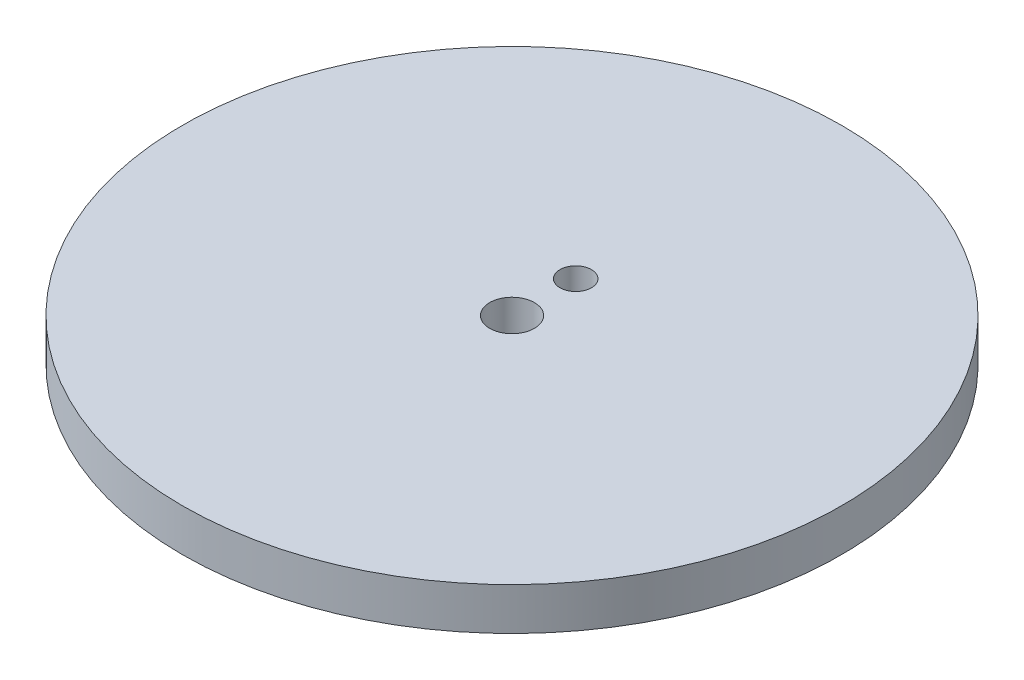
ISO-10303-21;
HEADER;
FILE_DESCRIPTION(('STEP AP214'),'2;1');
FILE_NAME('part.step','',(''),(''),'','','');
FILE_SCHEMA(('AUTOMOTIVE_DESIGN { 1 0 10303 214 1 1 1 1 }'));
ENDSEC;
DATA;
#1=APPLICATION_CONTEXT('core data for automotive mechanical design processes');
#2=APPLICATION_PROTOCOL_DEFINITION('international standard','automotive_design',2000,#1);
#3=PRODUCT_CONTEXT('',#1,'mechanical');
#4=PRODUCT('Part','Part','',(#3));
#5=PRODUCT_RELATED_PRODUCT_CATEGORY('part','',(#4));
#6=PRODUCT_DEFINITION_FORMATION('','',#4);
#7=PRODUCT_DEFINITION_CONTEXT('part definition',#1,'design');
#8=PRODUCT_DEFINITION('design','',#6,#7);
#9=PRODUCT_DEFINITION_SHAPE('','',#8);
#10=(LENGTH_UNIT() NAMED_UNIT(*) SI_UNIT(.MILLI.,.METRE.));
#11=(NAMED_UNIT(*) PLANE_ANGLE_UNIT() SI_UNIT($,.RADIAN.));
#12=(NAMED_UNIT(*) SI_UNIT($,.STERADIAN.) SOLID_ANGLE_UNIT());
#13=UNCERTAINTY_MEASURE_WITH_UNIT(LENGTH_MEASURE(1.E-05),#10,'distance_accuracy_value','');
#14=(GEOMETRIC_REPRESENTATION_CONTEXT(3) GLOBAL_UNCERTAINTY_ASSIGNED_CONTEXT((#13)) GLOBAL_UNIT_ASSIGNED_CONTEXT((#10,
#11,#12)) REPRESENTATION_CONTEXT('',''));
#15=CARTESIAN_POINT('',(0.,0.,0.));
#16=DIRECTION('',(0.,0.,1.));
#17=DIRECTION('',(1.,0.,0.));
#18=AXIS2_PLACEMENT_3D('',#15,#16,#17);
#19=CARTESIAN_POINT('',(0.,9.,0.));
#20=DIRECTION('',(0.,-1.,0.));
#21=DIRECTION('',(0.,0.,-1.));
#22=AXIS2_PLACEMENT_3D('',#19,#20,#21);
#23=CYLINDRICAL_SURFACE('',#22,70.);
#24=CARTESIAN_POINT('',(0.,9.,0.));
#25=DIRECTION('',(0.,1.,0.));
#26=DIRECTION('',(0.,0.,1.));
#27=AXIS2_PLACEMENT_3D('',#24,#25,#26);
#28=CIRCLE('',#27,70.);
#29=CARTESIAN_POINT('',(0.,9.,70.));
#30=VERTEX_POINT('',#29);
#31=EDGE_CURVE('E10',#30,#30,#28,.T.);
#32=ORIENTED_EDGE('',*,*,#31,.F.);
#33=EDGE_LOOP('',(#32));
#34=FACE_BOUND('',#33,.T.);
#35=CARTESIAN_POINT('',(0.,0.,0.));
#36=DIRECTION('',(0.,1.,0.));
#37=DIRECTION('',(0.,0.,1.));
#38=AXIS2_PLACEMENT_3D('',#35,#36,#37);
#39=CIRCLE('',#38,70.);
#40=CARTESIAN_POINT('',(0.,0.,70.));
#41=VERTEX_POINT('',#40);
#42=EDGE_CURVE('E40',#41,#41,#39,.T.);
#43=ORIENTED_EDGE('',*,*,#42,.T.);
#44=EDGE_LOOP('',(#43));
#45=FACE_BOUND('',#44,.T.);
#46=ADVANCED_FACE('F37',(#34,#45),#23,.T.);
#47=CARTESIAN_POINT('',(0.,9.,0.));
#48=DIRECTION('',(0.,1.,0.));
#49=DIRECTION('',(0.,0.,1.));
#50=AXIS2_PLACEMENT_3D('',#47,#48,#49);
#51=PLANE('',#50);
#52=CARTESIAN_POINT('',(-0.0103616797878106,9.,-0.0162571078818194));
#53=DIRECTION('',(0.,1.,0.));
#54=DIRECTION('',(0.,0.,1.));
#55=AXIS2_PLACEMENT_3D('',#52,#53,#54);
#56=CIRCLE('',#55,4.75);
#57=CARTESIAN_POINT('',(-0.0103616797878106,9.,4.73374289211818));
#58=VERTEX_POINT('',#57);
#59=EDGE_CURVE('E60',#58,#58,#56,.T.);
#60=ORIENTED_EDGE('',*,*,#59,.F.);
#61=EDGE_LOOP('',(#60));
#62=FACE_BOUND('',#61,.T.);
#63=CARTESIAN_POINT('',(-0.0103616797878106,9.,-13.54459274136));
#64=DIRECTION('',(0.,1.,0.));
#65=DIRECTION('',(0.,0.,1.));
#66=AXIS2_PLACEMENT_3D('',#63,#64,#65);
#67=CIRCLE('',#66,3.34536233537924);
#68=CARTESIAN_POINT('',(-0.0103616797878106,9.,-10.1992304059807));
#69=VERTEX_POINT('',#68);
#70=EDGE_CURVE('E51',#69,#69,#67,.T.);
#71=ORIENTED_EDGE('',*,*,#70,.F.);
#72=EDGE_LOOP('',(#71));
#73=FACE_BOUND('',#72,.T.);
#74=ORIENTED_EDGE('',*,*,#31,.T.);
#75=EDGE_LOOP('',(#74));
#76=FACE_BOUND('',#75,.T.);
#77=ADVANCED_FACE('F104',(#62,#73,#76),#51,.T.);
#78=CARTESIAN_POINT('',(0.,0.,0.));
#79=DIRECTION('',(0.,1.,0.));
#80=DIRECTION('',(0.,0.,1.));
#81=AXIS2_PLACEMENT_3D('',#78,#79,#80);
#82=PLANE('',#81);
#83=CARTESIAN_POINT('',(54.8960940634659,0.,-31.6942746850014));
#84=DIRECTION('',(0.,-1.,0.));
#85=DIRECTION('',(0.,0.,-1.));
#86=AXIS2_PLACEMENT_3D('',#83,#84,#85);
#87=CIRCLE('',#86,3.1);
#88=CARTESIAN_POINT('',(54.8960940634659,0.,-34.7942746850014));
#89=VERTEX_POINT('',#88);
#90=EDGE_CURVE('E83',#89,#89,#87,.T.);
#91=ORIENTED_EDGE('',*,*,#90,.F.);
#92=EDGE_LOOP('',(#91));
#93=FACE_BOUND('',#92,.T.);
#94=CARTESIAN_POINT('',(4.32352685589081E-12,0.,63.38854937));
#95=DIRECTION('',(0.,-1.,0.));
#96=DIRECTION('',(0.,0.,-1.));
#97=AXIS2_PLACEMENT_3D('',#94,#95,#96);
#98=CIRCLE('',#97,3.1);
#99=CARTESIAN_POINT('',(4.32352685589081E-12,0.,60.28854937));
#100=VERTEX_POINT('',#99);
#101=EDGE_CURVE('E75',#100,#100,#98,.T.);
#102=ORIENTED_EDGE('',*,*,#101,.F.);
#103=EDGE_LOOP('',(#102));
#104=FACE_BOUND('',#103,.T.);
#105=CARTESIAN_POINT('',(-54.8960940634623,0.,-31.6942746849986));
#106=DIRECTION('',(0.,-1.,0.));
#107=DIRECTION('',(0.,0.,-1.));
#108=AXIS2_PLACEMENT_3D('',#105,#106,#107);
#109=CIRCLE('',#108,3.09999999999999);
#110=CARTESIAN_POINT('',(-54.8960940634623,0.,-34.7942746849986));
#111=VERTEX_POINT('',#110);
#112=EDGE_CURVE('E67',#111,#111,#109,.T.);
#113=ORIENTED_EDGE('',*,*,#112,.F.);
#114=EDGE_LOOP('',(#113));
#115=FACE_BOUND('',#114,.T.);
#116=ORIENTED_EDGE('',*,*,#42,.F.);
#117=EDGE_LOOP('',(#116));
#118=FACE_BOUND('',#117,.T.);
#119=ADVANCED_FACE('F100',(#93,#104,#115,#118),#82,.F.);
#120=CARTESIAN_POINT('',(-0.0103616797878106,0.999999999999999,-13.54459274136));
#121=DIRECTION('',(0.,1.,0.));
#122=DIRECTION('',(0.,0.,1.));
#123=AXIS2_PLACEMENT_3D('',#120,#121,#122);
#124=CYLINDRICAL_SURFACE('',#123,3.34536233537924);
#125=CARTESIAN_POINT('',(-0.0103616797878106,0.999999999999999,-13.54459274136));
#126=DIRECTION('',(0.,1.,0.));
#127=DIRECTION('',(0.,0.,1.));
#128=AXIS2_PLACEMENT_3D('',#125,#126,#127);
#129=CIRCLE('',#128,3.34536233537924);
#130=CARTESIAN_POINT('',(-0.0103616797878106,0.999999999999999,-10.1992304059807));
#131=VERTEX_POINT('',#130);
#132=EDGE_CURVE('E55',#131,#131,#129,.T.);
#133=ORIENTED_EDGE('',*,*,#132,.F.);
#134=EDGE_LOOP('',(#133));
#135=FACE_BOUND('',#134,.T.);
#136=ORIENTED_EDGE('',*,*,#70,.T.);
#137=EDGE_LOOP('',(#136));
#138=FACE_BOUND('',#137,.T.);
#139=ADVANCED_FACE('F103',(#135,#138),#124,.F.);
#140=CARTESIAN_POINT('',(-0.0103616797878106,0.999999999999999,-13.54459274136));
#141=DIRECTION('',(0.,1.,0.));
#142=DIRECTION('',(0.,0.,1.));
#143=AXIS2_PLACEMENT_3D('',#140,#141,#142);
#144=PLANE('',#143);
#145=ORIENTED_EDGE('',*,*,#132,.T.);
#146=EDGE_LOOP('',(#145));
#147=FACE_BOUND('',#146,.T.);
#148=ADVANCED_FACE('F125',(#147),#144,.T.);
#149=CARTESIAN_POINT('',(-0.0103616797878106,0.999999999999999,-0.0162571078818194));
#150=DIRECTION('',(0.,1.,0.));
#151=DIRECTION('',(0.,0.,1.));
#152=AXIS2_PLACEMENT_3D('',#149,#150,#151);
#153=CYLINDRICAL_SURFACE('',#152,4.75);
#154=CARTESIAN_POINT('',(-0.0103616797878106,0.999999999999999,-0.0162571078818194));
#155=DIRECTION('',(0.,1.,0.));
#156=DIRECTION('',(0.,0.,1.));
#157=AXIS2_PLACEMENT_3D('',#154,#155,#156);
#158=CIRCLE('',#157,4.75);
#159=CARTESIAN_POINT('',(-0.0103616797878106,0.999999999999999,4.73374289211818));
#160=VERTEX_POINT('',#159);
#161=EDGE_CURVE('E49',#160,#160,#158,.T.);
#162=ORIENTED_EDGE('',*,*,#161,.F.);
#163=EDGE_LOOP('',(#162));
#164=FACE_BOUND('',#163,.T.);
#165=ORIENTED_EDGE('',*,*,#59,.T.);
#166=EDGE_LOOP('',(#165));
#167=FACE_BOUND('',#166,.T.);
#168=ADVANCED_FACE('F129',(#164,#167),#153,.F.);
#169=CARTESIAN_POINT('',(-0.0103616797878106,0.999999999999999,-0.0162571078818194));
#170=DIRECTION('',(0.,1.,0.));
#171=DIRECTION('',(0.,0.,1.));
#172=AXIS2_PLACEMENT_3D('',#169,#170,#171);
#173=PLANE('',#172);
#174=ORIENTED_EDGE('',*,*,#161,.T.);
#175=EDGE_LOOP('',(#174));
#176=FACE_BOUND('',#175,.T.);
#177=ADVANCED_FACE('F133',(#176),#173,.T.);
#178=CARTESIAN_POINT('',(-54.8960940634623,8.,-31.6942746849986));
#179=DIRECTION('',(0.,-1.,0.));
#180=DIRECTION('',(0.,0.,-1.));
#181=AXIS2_PLACEMENT_3D('',#178,#179,#180);
#182=CYLINDRICAL_SURFACE('',#181,3.09999999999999);
#183=CARTESIAN_POINT('',(-54.8960940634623,8.,-31.6942746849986));
#184=DIRECTION('',(0.,-1.,0.));
#185=DIRECTION('',(0.,0.,-1.));
#186=AXIS2_PLACEMENT_3D('',#183,#184,#185);
#187=CIRCLE('',#186,3.09999999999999);
#188=CARTESIAN_POINT('',(-54.8960940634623,8.,-34.7942746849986));
#189=VERTEX_POINT('',#188);
#190=EDGE_CURVE('E71',#189,#189,#187,.T.);
#191=ORIENTED_EDGE('',*,*,#190,.F.);
#192=EDGE_LOOP('',(#191));
#193=FACE_BOUND('',#192,.T.);
#194=ORIENTED_EDGE('',*,*,#112,.T.);
#195=EDGE_LOOP('',(#194));
#196=FACE_BOUND('',#195,.T.);
#197=ADVANCED_FACE('F137',(#193,#196),#182,.F.);
#198=CARTESIAN_POINT('',(-54.8960940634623,8.,-31.6942746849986));
#199=DIRECTION('',(0.,-1.,0.));
#200=DIRECTION('',(0.,0.,-1.));
#201=AXIS2_PLACEMENT_3D('',#198,#199,#200);
#202=PLANE('',#201);
#203=ORIENTED_EDGE('',*,*,#190,.T.);
#204=EDGE_LOOP('',(#203));
#205=FACE_BOUND('',#204,.T.);
#206=ADVANCED_FACE('F141',(#205),#202,.T.);
#207=CARTESIAN_POINT('',(4.32352685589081E-12,8.,63.38854937));
#208=DIRECTION('',(0.,-1.,0.));
#209=DIRECTION('',(0.,0.,-1.));
#210=AXIS2_PLACEMENT_3D('',#207,#208,#209);
#211=CYLINDRICAL_SURFACE('',#210,3.1);
#212=CARTESIAN_POINT('',(4.32352685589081E-12,8.,63.38854937));
#213=DIRECTION('',(0.,-1.,0.));
#214=DIRECTION('',(0.,0.,-1.));
#215=AXIS2_PLACEMENT_3D('',#212,#213,#214);
#216=CIRCLE('',#215,3.1);
#217=CARTESIAN_POINT('',(4.32352685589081E-12,8.,60.28854937));
#218=VERTEX_POINT('',#217);
#219=EDGE_CURVE('E79',#218,#218,#216,.T.);
#220=ORIENTED_EDGE('',*,*,#219,.F.);
#221=EDGE_LOOP('',(#220));
#222=FACE_BOUND('',#221,.T.);
#223=ORIENTED_EDGE('',*,*,#101,.T.);
#224=EDGE_LOOP('',(#223));
#225=FACE_BOUND('',#224,.T.);
#226=ADVANCED_FACE('F145',(#222,#225),#211,.F.);
#227=CARTESIAN_POINT('',(4.32352685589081E-12,8.,63.38854937));
#228=DIRECTION('',(0.,-1.,0.));
#229=DIRECTION('',(0.,0.,-1.));
#230=AXIS2_PLACEMENT_3D('',#227,#228,#229);
#231=PLANE('',#230);
#232=ORIENTED_EDGE('',*,*,#219,.T.);
#233=EDGE_LOOP('',(#232));
#234=FACE_BOUND('',#233,.T.);
#235=ADVANCED_FACE('F96',(#234),#231,.T.);
#236=CARTESIAN_POINT('',(54.8960940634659,8.,-31.6942746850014));
#237=DIRECTION('',(0.,-1.,0.));
#238=DIRECTION('',(0.,0.,-1.));
#239=AXIS2_PLACEMENT_3D('',#236,#237,#238);
#240=CYLINDRICAL_SURFACE('',#239,3.1);
#241=CARTESIAN_POINT('',(54.8960940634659,8.,-31.6942746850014));
#242=DIRECTION('',(0.,-1.,0.));
#243=DIRECTION('',(0.,0.,-1.));
#244=AXIS2_PLACEMENT_3D('',#241,#242,#243);
#245=CIRCLE('',#244,3.1);
#246=CARTESIAN_POINT('',(54.8960940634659,8.,-34.7942746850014));
#247=VERTEX_POINT('',#246);
#248=EDGE_CURVE('E56',#247,#247,#245,.T.);
#249=ORIENTED_EDGE('',*,*,#248,.F.);
#250=EDGE_LOOP('',(#249));
#251=FACE_BOUND('',#250,.T.);
#252=ORIENTED_EDGE('',*,*,#90,.T.);
#253=EDGE_LOOP('',(#252));
#254=FACE_BOUND('',#253,.T.);
#255=ADVANCED_FACE('F93',(#251,#254),#240,.F.);
#256=CARTESIAN_POINT('',(54.8960940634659,8.,-31.6942746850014));
#257=DIRECTION('',(0.,-1.,0.));
#258=DIRECTION('',(0.,0.,-1.));
#259=AXIS2_PLACEMENT_3D('',#256,#257,#258);
#260=PLANE('',#259);
#261=ORIENTED_EDGE('',*,*,#248,.T.);
#262=EDGE_LOOP('',(#261));
#263=FACE_BOUND('',#262,.T.);
#264=ADVANCED_FACE('F91',(#263),#260,.T.);
#265=CLOSED_SHELL('',(#46,#77,#119,#139,#148,#168,#177,#197,#206,#226,#235,#255,#264));
#266=MANIFOLD_SOLID_BREP('B2',#265);
#267=ADVANCED_BREP_SHAPE_REPRESENTATION('',(#18,#266),#14);
#268=SHAPE_DEFINITION_REPRESENTATION(#9,#267);
ENDSEC;
END-ISO-10303-21;
